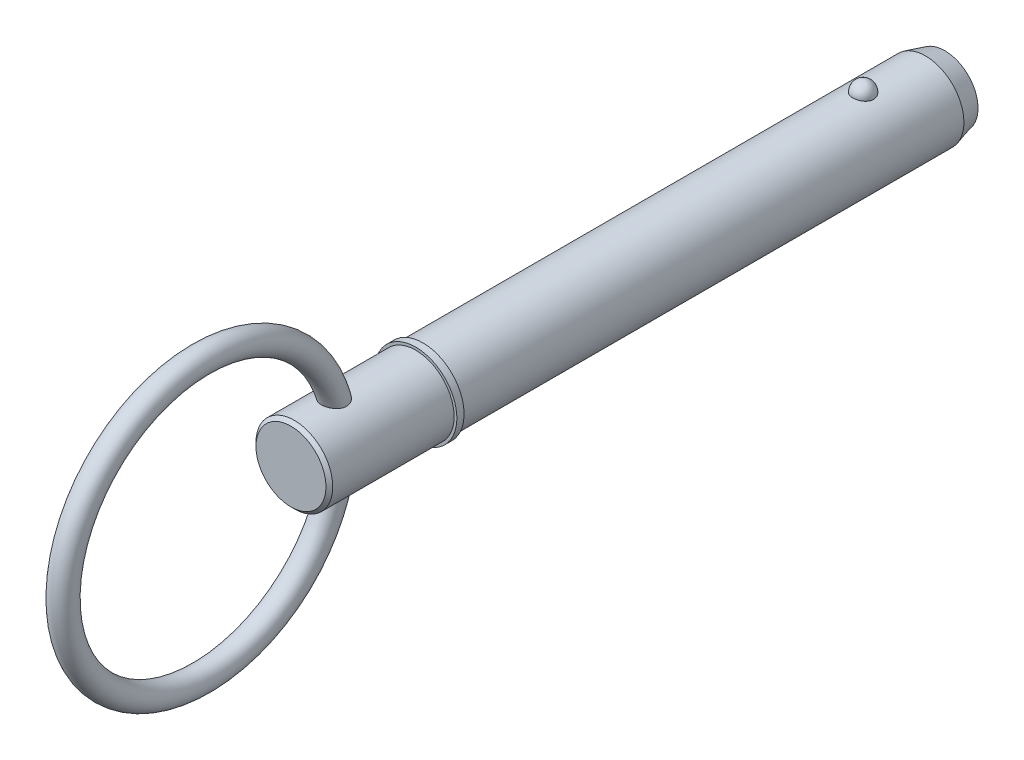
ISO-10303-21;
HEADER;
FILE_DESCRIPTION(('STEP AP214'),'2;1');
FILE_NAME('part.step','',(''),(''),'','','');
FILE_SCHEMA(('AUTOMOTIVE_DESIGN { 1 0 10303 214 1 1 1 1 }'));
ENDSEC;
DATA;
#1=APPLICATION_CONTEXT('core data for automotive mechanical design processes');
#2=APPLICATION_PROTOCOL_DEFINITION('international standard','automotive_design',2000,#1);
#3=PRODUCT_CONTEXT('',#1,'mechanical');
#4=PRODUCT('Part','Part','',(#3));
#5=PRODUCT_RELATED_PRODUCT_CATEGORY('part','',(#4));
#6=PRODUCT_DEFINITION_FORMATION('','',#4);
#7=PRODUCT_DEFINITION_CONTEXT('part definition',#1,'design');
#8=PRODUCT_DEFINITION('design','',#6,#7);
#9=PRODUCT_DEFINITION_SHAPE('','',#8);
#10=(LENGTH_UNIT() NAMED_UNIT(*) SI_UNIT(.MILLI.,.METRE.));
#11=(NAMED_UNIT(*) PLANE_ANGLE_UNIT() SI_UNIT($,.RADIAN.));
#12=(NAMED_UNIT(*) SI_UNIT($,.STERADIAN.) SOLID_ANGLE_UNIT());
#13=UNCERTAINTY_MEASURE_WITH_UNIT(LENGTH_MEASURE(1.E-05),#10,'distance_accuracy_value','');
#14=(GEOMETRIC_REPRESENTATION_CONTEXT(3) GLOBAL_UNCERTAINTY_ASSIGNED_CONTEXT((#13)) GLOBAL_UNIT_ASSIGNED_CONTEXT((#10,
#11,#12)) REPRESENTATION_CONTEXT('',''));
#15=CARTESIAN_POINT('',(0.,0.,0.));
#16=DIRECTION('',(0.,0.,1.));
#17=DIRECTION('',(1.,0.,0.));
#18=AXIS2_PLACEMENT_3D('',#15,#16,#17);
#19=CARTESIAN_POINT('',(0.,0.,88.9));
#20=DIRECTION('',(0.,0.,-1.));
#21=DIRECTION('',(-1.,0.,0.));
#22=AXIS2_PLACEMENT_3D('',#19,#20,#21);
#23=CYLINDRICAL_SURFACE('',#22,7.94);
#24=CARTESIAN_POINT('',(2.13020349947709,7.64891057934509,-2.15));
#25=CARTESIAN_POINT('',(2.1302012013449,7.64891247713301,-2.02978166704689));
#26=CARTESIAN_POINT('',(2.12037546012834,7.65166842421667,-1.90953383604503));
#27=CARTESIAN_POINT('',(2.08130792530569,7.66238579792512,-1.67243962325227));
#28=CARTESIAN_POINT('',(2.05205785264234,7.67034944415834,-1.55559471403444));
#29=CARTESIAN_POINT('',(1.97489181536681,7.69057749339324,-1.32869361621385));
#30=CARTESIAN_POINT('',(1.92698409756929,7.70283999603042,-1.21863445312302));
#31=CARTESIAN_POINT('',(1.81370645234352,7.73029430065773,-1.00831338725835));
#32=CARTESIAN_POINT('',(1.74833715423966,7.7454859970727,-0.908051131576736));
#33=CARTESIAN_POINT('',(1.60144242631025,7.77718699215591,-0.719628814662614));
#34=CARTESIAN_POINT('',(1.51984382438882,7.7937020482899,-0.631526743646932));
#35=CARTESIAN_POINT('',(1.34279837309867,7.82614685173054,-0.470411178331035));
#36=CARTESIAN_POINT('',(1.24735148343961,7.84207659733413,-0.397397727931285));
#37=CARTESIAN_POINT('',(1.04544839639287,7.87153116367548,-0.26868118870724));
#38=CARTESIAN_POINT('',(0.939022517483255,7.88506234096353,-0.212932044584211));
#39=CARTESIAN_POINT('',(0.717931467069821,7.90825597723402,-0.120080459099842));
#40=CARTESIAN_POINT('',(0.603267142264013,7.9179188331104,-0.0829761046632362));
#41=CARTESIAN_POINT('',(0.371015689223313,7.93216561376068,-0.0289596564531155));
#42=CARTESIAN_POINT('',(0.253510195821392,7.93683225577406,-0.0117183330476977));
#43=CARTESIAN_POINT('',(0.0171784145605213,7.94086051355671,0.0031892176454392));
#44=CARTESIAN_POINT('',(-0.101647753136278,7.94022260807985,0.00085721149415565));
#45=CARTESIAN_POINT('',(-0.335567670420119,7.93375751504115,-0.023146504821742));
#46=CARTESIAN_POINT('',(-0.450690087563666,7.92799987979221,-0.0445590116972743));
#47=CARTESIAN_POINT('',(-0.675610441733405,7.91200792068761,-0.105760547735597));
#48=CARTESIAN_POINT('',(-0.785408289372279,7.90177352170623,-0.145549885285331));
#49=CARTESIAN_POINT('',(-0.9972706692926,7.87784802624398,-0.242675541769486));
#50=CARTESIAN_POINT('',(-1.0992893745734,7.86413823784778,-0.300107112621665));
#51=CARTESIAN_POINT('',(-1.29223659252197,7.83474718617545,-0.430887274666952));
#52=CARTESIAN_POINT('',(-1.38316404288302,7.81906573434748,-0.504237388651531));
#53=CARTESIAN_POINT('',(-1.55313516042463,7.78710451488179,-0.666358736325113));
#54=CARTESIAN_POINT('',(-1.63193689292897,7.77081906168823,-0.75538257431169));
#55=CARTESIAN_POINT('',(-1.77366356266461,7.73970270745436,-0.945507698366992));
#56=CARTESIAN_POINT('',(-1.83658745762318,7.72487190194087,-1.04660977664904));
#57=CARTESIAN_POINT('',(-1.94556640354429,7.6981535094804,-1.25927689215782));
#58=CARTESIAN_POINT('',(-1.99143480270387,7.6862989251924,-1.3709418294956));
#59=CARTESIAN_POINT('',(-2.06418311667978,7.66708387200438,-1.60066153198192));
#60=CARTESIAN_POINT('',(-2.0910635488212,7.65972328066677,-1.71871612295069));
#61=CARTESIAN_POINT('',(-2.12508507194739,7.65035479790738,-1.9573607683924));
#62=CARTESIAN_POINT('',(-2.13230490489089,7.64832555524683,-2.0779387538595));
#63=CARTESIAN_POINT('',(-2.12704767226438,7.64978921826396,-2.31862835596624));
#64=CARTESIAN_POINT('',(-2.1145710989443,7.6532819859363,-2.43873998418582));
#65=CARTESIAN_POINT('',(-2.07034166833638,7.66536368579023,-2.67451689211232));
#66=CARTESIAN_POINT('',(-2.03867758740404,7.67392914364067,-2.79020005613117));
#67=CARTESIAN_POINT('',(-1.95694065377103,7.69517736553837,-3.01446692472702));
#68=CARTESIAN_POINT('',(-1.90686710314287,7.70786028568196,-3.12305035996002));
#69=CARTESIAN_POINT('',(-1.78925555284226,7.73600831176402,-3.3306597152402));
#70=CARTESIAN_POINT('',(-1.72162904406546,7.75148739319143,-3.4296336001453));
#71=CARTESIAN_POINT('',(-1.57074739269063,7.78346215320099,-3.61466914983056));
#72=CARTESIAN_POINT('',(-1.48749169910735,7.79995786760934,-3.70073035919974));
#73=CARTESIAN_POINT('',(-1.30720250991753,7.83219119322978,-3.85783594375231));
#74=CARTESIAN_POINT('',(-1.2101234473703,7.84792605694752,-3.92882863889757));
#75=CARTESIAN_POINT('',(-1.00503150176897,7.87681523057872,-4.05342383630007));
#76=CARTESIAN_POINT('',(-0.897019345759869,7.88996971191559,-4.10702749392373));
#77=CARTESIAN_POINT('',(-0.674439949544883,7.91208451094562,-4.19477736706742));
#78=CARTESIAN_POINT('',(-0.55996501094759,7.92109245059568,-4.22914554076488));
#79=CARTESIAN_POINT('',(-0.326625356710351,7.93413878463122,-4.27838865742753));
#80=CARTESIAN_POINT('',(-0.20776113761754,7.93817773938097,-4.29326579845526));
#81=CARTESIAN_POINT('',(0.0287357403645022,7.94081322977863,-4.3030062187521));
#82=CARTESIAN_POINT('',(0.14635312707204,7.93950453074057,-4.29821797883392));
#83=CARTESIAN_POINT('',(0.379062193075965,7.93180098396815,-4.26955229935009));
#84=CARTESIAN_POINT('',(0.494153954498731,7.92540630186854,-4.24567548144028));
#85=CARTESIAN_POINT('',(0.718185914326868,7.90824874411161,-4.17962260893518));
#86=CARTESIAN_POINT('',(0.827145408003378,7.89750055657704,-4.13750805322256));
#87=CARTESIAN_POINT('',(1.03638036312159,7.87277755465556,-4.03615078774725));
#88=CARTESIAN_POINT('',(1.13665531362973,7.85880255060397,-3.97690707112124));
#89=CARTESIAN_POINT('',(1.32729731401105,7.82887859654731,-3.84189297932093));
#90=CARTESIAN_POINT('',(1.41749828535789,7.81290379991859,-3.76589388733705));
#91=CARTESIAN_POINT('',(1.58397257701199,7.78086330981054,-3.59992466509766));
#92=CARTESIAN_POINT('',(1.66024342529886,7.76479760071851,-3.50995206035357));
#93=CARTESIAN_POINT('',(1.79805631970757,7.73405928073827,-3.31688321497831));
#94=CARTESIAN_POINT('',(1.85933944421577,7.719413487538,-3.213597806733));
#95=CARTESIAN_POINT('',(1.96397499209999,7.69345992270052,-2.99796163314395));
#96=CARTESIAN_POINT('',(2.00733488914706,7.68215076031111,-2.88561466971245));
#97=CARTESIAN_POINT('',(2.07068045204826,7.66529896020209,-2.6699413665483));
#98=CARTESIAN_POINT('',(2.09296296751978,7.65919990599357,-2.56732606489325));
#99=CARTESIAN_POINT('',(2.12272535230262,7.65100492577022,-2.35981463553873));
#100=CARTESIAN_POINT('',(2.13020550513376,7.64890892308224,-2.25491855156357));
#101=CARTESIAN_POINT('',(2.13020349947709,7.64891057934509,-2.15));
#102=B_SPLINE_CURVE_WITH_KNOTS('',3,(#24,#25,#26,#27,#28,#29,#30,#31,#32,#33,#34,#35,#36,#37,
#38,#39,#40,#41,#42,#43,#44,#45,#46,#47,#48,#49,#50,#51,#52,#53,#54,#55,#56,#57,#58,#59,#60,#61,
#62,#63,#64,#65,#66,#67,#68,#69,#70,#71,#72,#73,#74,#75,#76,#77,#78,#79,#80,#81,#82,#83,#84,#85,
#86,#87,#88,#89,#90,#91,#92,#93,#94,#95,#96,#97,#98,#99,#100,#101),.UNSPECIFIED.,.T.,.F.,(4,2,2,
2,2,2,2,2,2,2,2,2,2,2,2,2,2,2,2,2,2,2,2,2,2,2,2,2,2,2,2,2,2,2,2,2,2,2,4),(0.,0.360277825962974,
0.720709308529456,1.0809816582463,1.44124102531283,1.80316307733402,2.16508618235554,
2.52603531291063,2.88694740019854,3.24178717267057,3.59659491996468,3.94665496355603,
4.29672088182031,4.64871108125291,5.0007349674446,5.3590619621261,5.71741247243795,
6.079576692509,6.44173104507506,6.80243279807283,7.16312553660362,7.52216203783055,
7.88121215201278,8.24210915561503,8.60301888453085,8.96514709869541,9.32725124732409,
9.68508606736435,10.0428805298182,10.3943622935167,10.7458326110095,11.0961268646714,
11.4464417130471,11.8018724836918,12.1573662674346,12.5186252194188,12.8797333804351,
13.1941658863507,13.5085923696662),.UNSPECIFIED.);
#103=CARTESIAN_POINT('',(2.13020349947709,7.64891057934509,-2.15));
#104=VERTEX_POINT('',#103);
#105=EDGE_CURVE('E102',#104,#104,#102,.T.);
#106=ORIENTED_EDGE('',*,*,#105,.T.);
#107=EDGE_LOOP('',(#106));
#108=FACE_BOUND('',#107,.T.);
#109=CARTESIAN_POINT('',(0.,0.,-15.05));
#110=DIRECTION('',(0.,0.,-1.));
#111=DIRECTION('',(-1.,0.,0.));
#112=AXIS2_PLACEMENT_3D('',#109,#110,#111);
#113=CIRCLE('',#112,7.94);
#114=CARTESIAN_POINT('',(-7.94,0.,-15.05));
#115=VERTEX_POINT('',#114);
#116=EDGE_CURVE('E110',#115,#115,#113,.F.);
#117=ORIENTED_EDGE('',*,*,#116,.T.);
#118=EDGE_LOOP('',(#117));
#119=FACE_BOUND('',#118,.T.);
#120=CARTESIAN_POINT('',(0.,0.,88.9));
#121=DIRECTION('',(0.,0.,1.));
#122=DIRECTION('',(1.,0.,0.));
#123=AXIS2_PLACEMENT_3D('',#120,#121,#122);
#124=CIRCLE('',#123,7.94);
#125=CARTESIAN_POINT('',(7.94,0.,88.9));
#126=VERTEX_POINT('',#125);
#127=EDGE_CURVE('E108',#126,#126,#124,.T.);
#128=ORIENTED_EDGE('',*,*,#127,.F.);
#129=EDGE_LOOP('',(#128));
#130=FACE_BOUND('',#129,.T.);
#131=ADVANCED_FACE('F39',(#108,#119,#130),#23,.T.);
#132=CARTESIAN_POINT('',(0.,0.,-19.05));
#133=DIRECTION('',(0.,0.,-1.));
#134=DIRECTION('',(-1.,0.,0.));
#135=AXIS2_PLACEMENT_3D('',#132,#133,#134);
#136=PLANE('',#135);
#137=CARTESIAN_POINT('',(0.,0.,-19.05));
#138=DIRECTION('',(0.,0.,-1.));
#139=DIRECTION('',(-1.,0.,0.));
#140=AXIS2_PLACEMENT_3D('',#137,#138,#139);
#141=CIRCLE('',#140,6.86820323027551);
#142=CARTESIAN_POINT('',(-6.86820323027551,0.,-19.05));
#143=VERTEX_POINT('',#142);
#144=EDGE_CURVE('E140',#143,#143,#141,.T.);
#145=ORIENTED_EDGE('',*,*,#144,.T.);
#146=EDGE_LOOP('',(#145));
#147=FACE_BOUND('',#146,.T.);
#148=ADVANCED_FACE('F88',(#147),#136,.T.);
#149=CARTESIAN_POINT('',(0.,0.,-19.05));
#150=DIRECTION('',(0.,0.,1.));
#151=DIRECTION('',(1.,0.,0.));
#152=AXIS2_PLACEMENT_3D('',#149,#150,#151);
#153=CONICAL_SURFACE('',#152,6.86820323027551,0.261799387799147);
#154=ORIENTED_EDGE('',*,*,#116,.F.);
#155=EDGE_LOOP('',(#154));
#156=FACE_BOUND('',#155,.T.);
#157=ORIENTED_EDGE('',*,*,#144,.F.);
#158=EDGE_LOOP('',(#157));
#159=FACE_BOUND('',#158,.T.);
#160=ADVANCED_FACE('F94',(#156,#159),#153,.T.);
#161=CARTESIAN_POINT('',(0.,7.94,-2.15));
#162=DIRECTION('',(0.,1.,0.));
#163=DIRECTION('',(0.,0.,1.));
#164=AXIS2_PLACEMENT_3D('',#161,#162,#163);
#165=SPHERICAL_SURFACE('',#164,2.15);
#166=ORIENTED_EDGE('',*,*,#105,.F.);
#167=EDGE_LOOP('',(#166));
#168=FACE_BOUND('',#167,.T.);
#169=ADVANCED_FACE('F113',(#168),#165,.T.);
#170=CARTESIAN_POINT('',(0.,0.,88.9));
#171=DIRECTION('',(0.,0.,-1.));
#172=DIRECTION('',(-1.,0.,0.));
#173=AXIS2_PLACEMENT_3D('',#170,#171,#172);
#174=PLANE('',#173);
#175=ORIENTED_EDGE('',*,*,#127,.T.);
#176=EDGE_LOOP('',(#175));
#177=FACE_BOUND('',#176,.T.);
#178=CARTESIAN_POINT('',(0.,0.,88.9));
#179=DIRECTION('',(0.,0.,-1.));
#180=DIRECTION('',(-1.,0.,0.));
#181=AXIS2_PLACEMENT_3D('',#178,#179,#180);
#182=CIRCLE('',#181,8.5);
#183=CARTESIAN_POINT('',(-8.5,0.,88.9));
#184=VERTEX_POINT('',#183);
#185=EDGE_CURVE('E109',#184,#184,#182,.T.);
#186=ORIENTED_EDGE('',*,*,#185,.T.);
#187=EDGE_LOOP('',(#186));
#188=FACE_BOUND('',#187,.T.);
#189=ADVANCED_FACE('F117',(#177,#188),#174,.T.);
#190=CARTESIAN_POINT('',(0.,0.,33.7287874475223));
#191=DIRECTION('',(0.,0.,-1.));
#192=DIRECTION('',(-1.,0.,0.));
#193=AXIS2_PLACEMENT_3D('',#190,#191,#192);
#194=CYLINDRICAL_SURFACE('',#193,8.5);
#195=CARTESIAN_POINT('',(0.,0.,90.4));
#196=DIRECTION('',(0.,0.,-1.));
#197=DIRECTION('',(-1.,0.,0.));
#198=AXIS2_PLACEMENT_3D('',#195,#196,#197);
#199=CIRCLE('',#198,8.5);
#200=CARTESIAN_POINT('',(-8.5,0.,90.4));
#201=VERTEX_POINT('',#200);
#202=EDGE_CURVE('E134',#201,#201,#199,.T.);
#203=ORIENTED_EDGE('',*,*,#202,.T.);
#204=EDGE_LOOP('',(#203));
#205=FACE_BOUND('',#204,.T.);
#206=ORIENTED_EDGE('',*,*,#185,.F.);
#207=EDGE_LOOP('',(#206));
#208=FACE_BOUND('',#207,.T.);
#209=ADVANCED_FACE('F121',(#205,#208),#194,.T.);
#210=CARTESIAN_POINT('',(0.,8.5,90.4));
#211=DIRECTION('',(0.,0.,1.));
#212=DIRECTION('',(1.,0.,0.));
#213=AXIS2_PLACEMENT_3D('',#210,#211,#212);
#214=PLANE('',#213);
#215=CARTESIAN_POINT('',(0.,0.,90.4));
#216=DIRECTION('',(0.,0.,1.));
#217=DIRECTION('',(1.,0.,0.));
#218=AXIS2_PLACEMENT_3D('',#215,#216,#217);
#219=CIRCLE('',#218,7.94);
#220=CARTESIAN_POINT('',(7.94,0.,90.4));
#221=VERTEX_POINT('',#220);
#222=EDGE_CURVE('E112',#221,#221,#219,.T.);
#223=ORIENTED_EDGE('',*,*,#222,.F.);
#224=EDGE_LOOP('',(#223));
#225=FACE_BOUND('',#224,.T.);
#226=ORIENTED_EDGE('',*,*,#202,.F.);
#227=EDGE_LOOP('',(#226));
#228=FACE_BOUND('',#227,.T.);
#229=ADVANCED_FACE('F85',(#225,#228),#214,.T.);
#230=CARTESIAN_POINT('',(0.,0.,116.21));
#231=DIRECTION('',(0.,0.,-1.));
#232=DIRECTION('',(-1.,0.,0.));
#233=AXIS2_PLACEMENT_3D('',#230,#231,#232);
#234=CYLINDRICAL_SURFACE('',#233,7.94);
#235=CARTESIAN_POINT('',(-1.15544091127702,-7.85547938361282,105.011910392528));
#236=CARTESIAN_POINT('',(-1.03089695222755,-7.87379554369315,104.949615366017));
#237=CARTESIAN_POINT('',(-0.900845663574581,-7.8898743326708,104.897593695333));
#238=CARTESIAN_POINT('',(-0.633417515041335,-7.91583465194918,104.815265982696));
#239=CARTESIAN_POINT('',(-0.496037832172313,-7.92571377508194,104.784968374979));
#240=CARTESIAN_POINT('',(-0.217881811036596,-7.93823020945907,104.746773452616));
#241=CARTESIAN_POINT('',(-0.0771057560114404,-7.94086812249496,104.738874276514));
#242=CARTESIAN_POINT('',(0.20382834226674,-7.93862624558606,104.745648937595));
#243=CARTESIAN_POINT('',(0.343986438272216,-7.93374711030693,104.760320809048));
#244=CARTESIAN_POINT('',(0.61954486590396,-7.9169944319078,104.811877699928));
#245=CARTESIAN_POINT('',(0.754950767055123,-7.9051293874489,104.848735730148));
#246=CARTESIAN_POINT('',(1.01737529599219,-7.8756583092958,104.943842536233));
#247=CARTESIAN_POINT('',(1.14439334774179,-7.85805188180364,105.002092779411));
#248=CARTESIAN_POINT('',(1.38668443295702,-7.81893907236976,105.138842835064));
#249=CARTESIAN_POINT('',(1.50193494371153,-7.79742542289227,105.217380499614));
#250=CARTESIAN_POINT('',(1.71711272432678,-7.75288428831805,105.392872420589));
#251=CARTESIAN_POINT('',(1.81704089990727,-7.72985689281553,105.489825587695));
#252=CARTESIAN_POINT('',(1.99787261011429,-7.68509802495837,105.69887149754));
#253=CARTESIAN_POINT('',(2.07893183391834,-7.66335713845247,105.810827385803));
#254=CARTESIAN_POINT('',(2.2207658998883,-7.6234672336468,106.047480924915));
#255=CARTESIAN_POINT('',(2.28154607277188,-7.6053172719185,106.172175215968));
#256=CARTESIAN_POINT('',(2.38011540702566,-7.57504217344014,106.427618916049));
#257=CARTESIAN_POINT('',(2.41840843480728,-7.56278621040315,106.558158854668));
#258=CARTESIAN_POINT('',(2.47363993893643,-7.54490265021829,106.824095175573));
#259=CARTESIAN_POINT('',(2.49057788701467,-7.53927521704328,106.959491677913));
#260=CARTESIAN_POINT('',(2.50351014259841,-7.53499042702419,107.23242871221));
#261=CARTESIAN_POINT('',(2.49933630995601,-7.53638902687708,107.369977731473));
#262=CARTESIAN_POINT('',(2.47072547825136,-7.54581524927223,107.642698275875));
#263=CARTESIAN_POINT('',(2.44628184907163,-7.55384504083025,107.777869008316));
#264=CARTESIAN_POINT('',(2.3758931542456,-7.57629160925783,108.053085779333));
#265=CARTESIAN_POINT('',(2.32844094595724,-7.5911515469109,108.19270896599));
#266=CARTESIAN_POINT('',(2.21332780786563,-7.62550828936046,108.462781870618));
#267=CARTESIAN_POINT('',(2.14565489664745,-7.64500784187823,108.593226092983));
#268=CARTESIAN_POINT('',(1.98438755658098,-7.68852412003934,108.853702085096));
#269=CARTESIAN_POINT('',(1.88896913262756,-7.71279219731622,108.982569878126));
#270=CARTESIAN_POINT('',(1.67743245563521,-7.76154719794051,109.222112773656));
#271=CARTESIAN_POINT('',(1.56130644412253,-7.78603420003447,109.332781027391));
#272=CARTESIAN_POINT('',(1.31168281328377,-7.83191501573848,109.530100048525));
#273=CARTESIAN_POINT('',(1.17841631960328,-7.85334315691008,109.617029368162));
#274=CARTESIAN_POINT('',(0.967442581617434,-7.88116219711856,109.726657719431));
#275=CARTESIAN_POINT('',(0.895283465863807,-7.88971376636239,109.759736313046));
#276=CARTESIAN_POINT('',(0.747777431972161,-7.90505596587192,109.818400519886));
#277=CARTESIAN_POINT('',(0.672431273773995,-7.91184701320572,109.843987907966));
#278=CARTESIAN_POINT('',(0.53057561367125,-7.92252382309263,109.883912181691));
#279=CARTESIAN_POINT('',(0.46439476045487,-7.92668987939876,109.899349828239));
#280=CARTESIAN_POINT('',(0.330815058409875,-7.9333870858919,109.924069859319));
#281=CARTESIAN_POINT('',(0.263416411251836,-7.93591850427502,109.93335325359));
#282=CARTESIAN_POINT('',(0.128041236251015,-7.93925585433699,109.945577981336));
#283=CARTESIAN_POINT('',(0.0600650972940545,-7.94006286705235,109.948523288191));
#284=CARTESIAN_POINT('',(-0.075840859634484,-7.93992929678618,109.948033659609));
#285=CARTESIAN_POINT('',(-0.143770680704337,-7.93898884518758,109.944599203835));
#286=CARTESIAN_POINT('',(-0.330023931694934,-7.93402174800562,109.926406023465));
#287=CARTESIAN_POINT('',(-0.447720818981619,-7.92820264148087,109.905060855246));
#288=CARTESIAN_POINT('',(-0.677833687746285,-7.91185818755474,109.844093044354));
#289=CARTESIAN_POINT('',(-0.790248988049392,-7.90133223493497,109.804468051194));
#290=CARTESIAN_POINT('',(-1.01082100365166,-7.8762011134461,109.707436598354));
#291=CARTESIAN_POINT('',(-1.1187367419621,-7.86147932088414,109.649515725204));
#292=CARTESIAN_POINT('',(-1.32464461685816,-7.82941891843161,109.518755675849));
#293=CARTESIAN_POINT('',(-1.42263264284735,-7.81207923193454,109.445910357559));
#294=CARTESIAN_POINT('',(-1.62038324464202,-7.77363945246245,109.276536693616));
#295=CARTESIAN_POINT('',(-1.7184938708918,-7.75235190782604,109.178123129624));
#296=CARTESIAN_POINT('',(-1.89908721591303,-7.71010284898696,108.967783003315));
#297=CARTESIAN_POINT('',(-1.9815587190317,-7.68914157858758,108.855846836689));
#298=CARTESIAN_POINT('',(-2.13974270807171,-7.64674394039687,108.605108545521));
#299=CARTESIAN_POINT('',(-2.21304020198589,-7.62562536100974,108.464719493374));
#300=CARTESIAN_POINT('',(-2.33615659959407,-7.58881542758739,108.173266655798));
#301=CARTESIAN_POINT('',(-2.38596943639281,-7.57312547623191,108.022200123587));
#302=CARTESIAN_POINT('',(-2.46059473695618,-7.54921618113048,107.710492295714));
#303=CARTESIAN_POINT('',(-2.48494918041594,-7.54113395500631,107.549728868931));
#304=CARTESIAN_POINT('',(-2.50480773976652,-7.53456588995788,107.226244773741));
#305=CARTESIAN_POINT('',(-2.50033692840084,-7.53607171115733,107.063525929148));
#306=CARTESIAN_POINT('',(-2.46306926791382,-7.54832452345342,106.757165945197));
#307=CARTESIAN_POINT('',(-2.4329569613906,-7.55819528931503,106.613162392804));
#308=CARTESIAN_POINT('',(-2.34806892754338,-7.58499431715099,106.333304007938));
#309=CARTESIAN_POINT('',(-2.29330013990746,-7.60192059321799,106.197446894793));
#310=CARTESIAN_POINT('',(-2.16523724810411,-7.63933506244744,105.94765733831));
#311=CARTESIAN_POINT('',(-2.09353456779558,-7.65948502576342,105.832853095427));
#312=CARTESIAN_POINT('',(-1.93200913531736,-7.7018104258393,105.617268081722));
#313=CARTESIAN_POINT('',(-1.84219262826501,-7.72398516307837,105.516482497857));
#314=CARTESIAN_POINT('',(-1.65746337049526,-7.76558957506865,105.34131484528));
#315=CARTESIAN_POINT('',(-1.56413624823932,-7.78505810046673,105.265259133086));
#316=CARTESIAN_POINT('',(-1.36706423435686,-7.82207051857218,105.12753576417));
#317=CARTESIAN_POINT('',(-1.26331856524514,-7.83961426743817,105.065869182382));
#318=CARTESIAN_POINT('',(-1.15544091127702,-7.85547938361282,105.011910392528));
#319=B_SPLINE_CURVE_WITH_KNOTS('',3,(#235,#236,#237,#238,#239,#240,#241,#242,#243,#244,#245,
#246,#247,#248,#249,#250,#251,#252,#253,#254,#255,#256,#257,#258,#259,#260,#261,#262,#263,#264,
#265,#266,#267,#268,#269,#270,#271,#272,#273,#274,#275,#276,#277,#278,#279,#280,#281,#282,#283,
#284,#285,#286,#287,#288,#289,#290,#291,#292,#293,#294,#295,#296,#297,#298,#299,#300,#301,#302,
#303,#304,#305,#306,#307,#308,#309,#310,#311,#312,#313,#314,#315,#316,#317,#318),.UNSPECIFIED.,
.T.,.F.,(4,2,2,2,2,2,2,2,2,2,2,2,2,2,2,2,2,2,2,2,2,2,2,2,2,2,2,2,2,2,2,2,2,2,2,2,2,2,2,2,2,4),
(0.,0.420927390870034,0.842018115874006,1.26307384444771,1.68409290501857,2.10460083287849,
2.52513760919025,2.94646475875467,3.36776699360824,3.78545897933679,4.20304108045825,
4.61086922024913,5.01870744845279,5.42979890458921,5.84102487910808,6.2838331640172,
6.72690434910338,7.21113455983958,7.69554657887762,8.17400305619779,8.41316278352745,
8.65226580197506,8.85622998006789,9.06016068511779,9.26396350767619,9.4677510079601,
9.8252104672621,10.1827159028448,10.5513335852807,10.9201032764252,11.3402098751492,
11.7606166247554,12.2377707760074,12.715048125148,13.2007716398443,13.6860727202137,
14.1260485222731,14.5659005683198,14.9745225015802,15.3830037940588,15.7475760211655,
16.1121754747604),.UNSPECIFIED.);
#320=CARTESIAN_POINT('',(-1.15544091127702,-7.85547938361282,105.011910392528));
#321=VERTEX_POINT('',#320);
#322=EDGE_CURVE('E10',#321,#321,#319,.T.);
#323=ORIENTED_EDGE('',*,*,#322,.F.);
#324=EDGE_LOOP('',(#323));
#325=FACE_BOUND('',#324,.T.);
#326=CARTESIAN_POINT('',(-1.15544091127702,7.85547938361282,105.011910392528));
#327=CARTESIAN_POINT('',(-1.278579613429,7.83736699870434,105.073507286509));
#328=CARTESIAN_POINT('',(-1.39638360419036,7.8170599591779,105.145172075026));
#329=CARTESIAN_POINT('',(-1.61803025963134,7.77421032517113,105.30708252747));
#330=CARTESIAN_POINT('',(-1.72186951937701,7.7516671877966,105.39733270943));
#331=CARTESIAN_POINT('',(-1.9126968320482,7.70680387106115,105.594395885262));
#332=CARTESIAN_POINT('',(-1.99967065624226,7.68448389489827,105.701222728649));
#333=CARTESIAN_POINT('',(-2.15412555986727,7.64262858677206,105.928607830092));
#334=CARTESIAN_POINT('',(-2.2216118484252,7.62309251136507,106.049162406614));
#335=CARTESIAN_POINT('',(-2.3342927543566,7.5893410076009,106.298377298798));
#336=CARTESIAN_POINT('',(-2.3798562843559,7.57503857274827,106.426859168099));
#337=CARTESIAN_POINT('',(-2.44955571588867,7.55278941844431,106.690011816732));
#338=CARTESIAN_POINT('',(-2.47369226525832,7.544842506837,106.82468240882));
#339=CARTESIAN_POINT('',(-2.50059611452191,7.53596831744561,107.096137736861));
#340=CARTESIAN_POINT('',(-2.50339277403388,7.53503139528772,107.232919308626));
#341=CARTESIAN_POINT('',(-2.48855779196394,7.53994222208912,107.505224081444));
#342=CARTESIAN_POINT('',(-2.47092012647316,7.54579197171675,107.64074689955));
#343=CARTESIAN_POINT('',(-2.41469361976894,7.56397908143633,107.916293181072));
#344=CARTESIAN_POINT('',(-2.37479606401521,7.57671999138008,108.05602135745));
#345=CARTESIAN_POINT('',(-2.27489955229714,7.60730881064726,108.327515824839));
#346=CARTESIAN_POINT('',(-2.2148900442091,7.6251594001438,108.459277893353));
#347=CARTESIAN_POINT('',(-2.06943931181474,7.66598084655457,108.72452508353));
#348=CARTESIAN_POINT('',(-1.98208275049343,7.68928197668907,108.856914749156));
#349=CARTESIAN_POINT('',(-1.78658869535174,7.73704343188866,109.105235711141));
#350=CARTESIAN_POINT('',(-1.67843905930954,7.76150442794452,109.221157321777));
#351=CARTESIAN_POINT('',(-1.44142605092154,7.80900750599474,109.433699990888));
#352=CARTESIAN_POINT('',(-1.31231821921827,7.83202775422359,109.530058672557));
#353=CARTESIAN_POINT('',(-1.10627655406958,7.86286215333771,109.654614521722));
#354=CARTESIAN_POINT('',(-1.035525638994,7.87252500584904,109.692805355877));
#355=CARTESIAN_POINT('',(-0.890375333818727,7.89025728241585,109.761885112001));
#356=CARTESIAN_POINT('',(-0.815978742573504,7.89832790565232,109.792779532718));
#357=CARTESIAN_POINT('',(-0.674180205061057,7.91160332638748,109.843082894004));
#358=CARTESIAN_POINT('',(-0.607145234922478,7.91704543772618,109.863468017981));
#359=CARTESIAN_POINT('',(-0.47138569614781,7.92628663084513,109.897876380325));
#360=CARTESIAN_POINT('',(-0.402662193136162,7.93008672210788,109.911903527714));
#361=CARTESIAN_POINT('',(-0.264153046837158,7.9359070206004,109.933322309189));
#362=CARTESIAN_POINT('',(-0.194368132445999,7.9379283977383,109.940718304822));
#363=CARTESIAN_POINT('',(-0.0544054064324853,7.940122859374,109.948743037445));
#364=CARTESIAN_POINT('',(0.0157723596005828,7.94029615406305,109.949372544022));
#365=CARTESIAN_POINT('',(0.206295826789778,7.93822912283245,109.941825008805));
#366=CARTESIAN_POINT('',(0.326425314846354,7.93416340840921,109.926989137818));
#367=CARTESIAN_POINT('',(0.562310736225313,7.92094769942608,109.878077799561));
#368=CARTESIAN_POINT('',(0.678066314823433,7.91179729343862,109.84400077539));
#369=CARTESIAN_POINT('',(0.903029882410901,7.88929555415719,109.758269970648));
#370=CARTESIAN_POINT('',(1.01220356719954,7.87592415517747,109.706532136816));
#371=CARTESIAN_POINT('',(1.22142047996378,7.84620431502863,109.587793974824));
#372=CARTESIAN_POINT('',(1.32146048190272,7.82985482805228,109.520788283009));
#373=CARTESIAN_POINT('',(1.52328754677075,7.7932678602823,109.364309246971));
#374=CARTESIAN_POINT('',(1.6236508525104,7.77280069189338,109.273056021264));
#375=CARTESIAN_POINT('',(1.80985117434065,7.73156849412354,109.076815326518));
#376=CARTESIAN_POINT('',(1.895678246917,7.71080327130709,108.97181854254));
#377=CARTESIAN_POINT('',(2.06302404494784,7.66785771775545,108.734543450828));
#378=CARTESIAN_POINT('',(2.14213178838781,7.64590590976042,108.600514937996));
#379=CARTESIAN_POINT('',(2.27825755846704,7.60645646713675,108.320994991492));
#380=CARTESIAN_POINT('',(2.33526577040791,7.58896081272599,108.175498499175));
#381=CARTESIAN_POINT('',(2.42707573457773,7.56011538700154,107.870242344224));
#382=CARTESIAN_POINT('',(2.4608459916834,7.54905411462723,107.710140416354));
#383=CARTESIAN_POINT('',(2.49980168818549,7.53624914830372,107.386129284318));
#384=CARTESIAN_POINT('',(2.50500938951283,7.5344981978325,107.222223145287));
#385=CARTESIAN_POINT('',(2.48594104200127,7.54080673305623,106.909976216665));
#386=CARTESIAN_POINT('',(2.46407777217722,7.54806351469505,106.761473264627));
#387=CARTESIAN_POINT('',(2.3945479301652,7.57040718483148,106.471258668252));
#388=CARTESIAN_POINT('',(2.34689355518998,7.58549037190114,106.329543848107));
#389=CARTESIAN_POINT('',(2.2318274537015,7.62009243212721,106.069141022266));
#390=CARTESIAN_POINT('',(2.16637710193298,7.63914093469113,105.949517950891));
#391=CARTESIAN_POINT('',(2.01638736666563,7.68009146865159,105.72346099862));
#392=CARTESIAN_POINT('',(1.93184850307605,7.7019934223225,105.617026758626));
#393=CARTESIAN_POINT('',(1.74664202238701,7.74608439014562,105.42066977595));
#394=CARTESIAN_POINT('',(1.64607913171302,7.76827073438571,105.33064744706));
#395=CARTESIAN_POINT('',(1.43119791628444,7.81071401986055,105.168308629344));
#396=CARTESIAN_POINT('',(1.31687846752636,7.83097080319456,105.095993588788));
#397=CARTESIAN_POINT('',(1.07477437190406,7.86789551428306,104.969149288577));
#398=CARTESIAN_POINT('',(0.946739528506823,7.88446964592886,104.915069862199));
#399=CARTESIAN_POINT('',(0.683029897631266,7.91167708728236,104.828213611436));
#400=CARTESIAN_POINT('',(0.547354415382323,7.92230985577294,104.795438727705));
#401=CARTESIAN_POINT('',(0.271066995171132,7.93658630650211,104.751730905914));
#402=CARTESIAN_POINT('',(0.130424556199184,7.94017418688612,104.740972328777));
#403=CARTESIAN_POINT('',(-0.150736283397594,7.93981282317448,104.742062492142));
#404=CARTESIAN_POINT('',(-0.291254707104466,7.93586558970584,104.753905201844));
#405=CARTESIAN_POINT('',(-0.556023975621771,7.92151946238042,104.797891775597));
#406=CARTESIAN_POINT('',(-0.680621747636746,7.91171585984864,104.828166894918));
#407=CARTESIAN_POINT('',(-0.923476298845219,7.88705844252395,104.906736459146));
#408=CARTESIAN_POINT('',(-1.04173303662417,7.87220459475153,104.955031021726));
#409=CARTESIAN_POINT('',(-1.15544091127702,7.85547938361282,105.011910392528));
#410=B_SPLINE_CURVE_WITH_KNOTS('',3,(#326,#327,#328,#329,#330,#331,#332,#333,#334,#335,#336,
#337,#338,#339,#340,#341,#342,#343,#344,#345,#346,#347,#348,#349,#350,#351,#352,#353,#354,#355,
#356,#357,#358,#359,#360,#361,#362,#363,#364,#365,#366,#367,#368,#369,#370,#371,#372,#373,#374,
#375,#376,#377,#378,#379,#380,#381,#382,#383,#384,#385,#386,#387,#388,#389,#390,#391,#392,#393,
#394,#395,#396,#397,#398,#399,#400,#401,#402,#403,#404,#405,#406,#407,#408,#409),.UNSPECIFIED.,
.T.,.F.,(4,2,2,2,2,2,2,2,2,2,2,2,2,2,2,2,2,2,2,2,2,2,2,2,2,2,2,2,2,2,2,2,2,2,2,2,2,2,2,2,2,4),
(0.,0.416167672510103,0.832436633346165,1.24905527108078,1.66556244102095,2.07479168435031,
2.48400855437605,2.89266231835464,3.30143658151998,3.73725068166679,4.17329379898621,
4.65204873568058,5.13108409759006,5.61617224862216,5.85876072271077,6.10116578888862,
6.31168904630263,6.52208269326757,6.7323378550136,6.94256910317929,7.30398888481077,
7.66543791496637,8.02863174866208,8.39195337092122,8.80190673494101,9.21213940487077,
9.68159903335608,10.1512669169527,10.6406305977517,11.1296128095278,11.5779838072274,
12.0261429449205,12.4372146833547,12.8482752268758,13.256751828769,13.6652618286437,
14.0832160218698,14.5012082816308,14.9224982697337,15.3436758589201,15.72796797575,
16.1122626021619),.UNSPECIFIED.);
#411=CARTESIAN_POINT('',(-1.15544091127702,7.85547938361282,105.011910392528));
#412=VERTEX_POINT('',#411);
#413=EDGE_CURVE('E51',#412,#412,#410,.T.);
#414=ORIENTED_EDGE('',*,*,#413,.F.);
#415=EDGE_LOOP('',(#414));
#416=FACE_BOUND('',#415,.T.);
#417=CARTESIAN_POINT('',(0.,0.,115.51));
#418=DIRECTION('',(0.,0.,-1.));
#419=DIRECTION('',(-1.,0.,0.));
#420=AXIS2_PLACEMENT_3D('',#417,#418,#419);
#421=CIRCLE('',#420,7.94);
#422=CARTESIAN_POINT('',(-7.94,0.,115.51));
#423=VERTEX_POINT('',#422);
#424=EDGE_CURVE('E64',#423,#423,#421,.T.);
#425=ORIENTED_EDGE('',*,*,#424,.T.);
#426=EDGE_LOOP('',(#425));
#427=FACE_BOUND('',#426,.T.);
#428=ORIENTED_EDGE('',*,*,#222,.T.);
#429=EDGE_LOOP('',(#428));
#430=FACE_BOUND('',#429,.T.);
#431=ADVANCED_FACE('F69',(#325,#416,#427,#430),#234,.T.);
#432=CARTESIAN_POINT('',(0.,0.,116.21));
#433=DIRECTION('',(0.,0.,-1.));
#434=DIRECTION('',(-1.,0.,0.));
#435=AXIS2_PLACEMENT_3D('',#432,#433,#434);
#436=PLANE('',#435);
#437=CARTESIAN_POINT('',(0.,0.,116.21));
#438=DIRECTION('',(0.,0.,-1.));
#439=DIRECTION('',(-1.,0.,0.));
#440=AXIS2_PLACEMENT_3D('',#437,#438,#439);
#441=CIRCLE('',#440,7.24);
#442=CARTESIAN_POINT('',(-7.24,0.,116.21));
#443=VERTEX_POINT('',#442);
#444=EDGE_CURVE('E57',#443,#443,#441,.F.);
#445=ORIENTED_EDGE('',*,*,#444,.T.);
#446=EDGE_LOOP('',(#445));
#447=FACE_BOUND('',#446,.T.);
#448=ADVANCED_FACE('F76',(#447),#436,.F.);
#449=CARTESIAN_POINT('',(0.,0.,115.51));
#450=DIRECTION('',(0.,0.,-1.));
#451=DIRECTION('',(-1.,0.,0.));
#452=AXIS2_PLACEMENT_3D('',#449,#450,#451);
#453=CONICAL_SURFACE('',#452,7.94,0.785398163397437);
#454=ORIENTED_EDGE('',*,*,#444,.F.);
#455=EDGE_LOOP('',(#454));
#456=FACE_BOUND('',#455,.T.);
#457=ORIENTED_EDGE('',*,*,#424,.F.);
#458=EDGE_LOOP('',(#457));
#459=FACE_BOUND('',#458,.T.);
#460=ADVANCED_FACE('F41',(#456,#459),#453,.T.);
#461=CARTESIAN_POINT('',(0.,0.,134.785));
#462=DIRECTION('',(1.,0.,0.));
#463=DIRECTION('',(0.,0.,-1.));
#464=AXIS2_PLACEMENT_3D('',#461,#462,#463);
#465=TOROIDAL_SURFACE('',#464,28.575,2.5);
#466=ORIENTED_EDGE('',*,*,#322,.T.);
#467=EDGE_LOOP('',(#466));
#468=FACE_BOUND('',#467,.T.);
#469=ORIENTED_EDGE('',*,*,#413,.T.);
#470=EDGE_LOOP('',(#469));
#471=FACE_BOUND('',#470,.T.);
#472=ADVANCED_FACE('F73',(#468,#471),#465,.T.);
#473=CLOSED_SHELL('',(#131,#148,#160,#169,#189,#209,#229,#431,#448,#460,#472));
#474=MANIFOLD_SOLID_BREP('B2',#473);
#475=ADVANCED_BREP_SHAPE_REPRESENTATION('',(#18,#474),#14);
#476=SHAPE_DEFINITION_REPRESENTATION(#9,#475);
ENDSEC;
END-ISO-10303-21;
